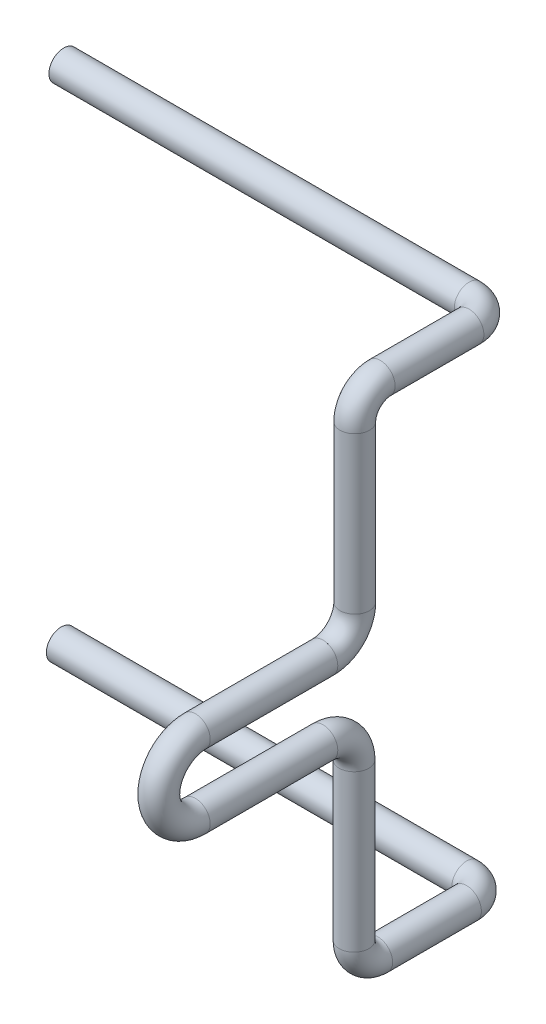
ISO-10303-21;
HEADER;
FILE_DESCRIPTION(('STEP AP214'),'2;1');
FILE_NAME('part.step','',(''),(''),'','','');
FILE_SCHEMA(('AUTOMOTIVE_DESIGN { 1 0 10303 214 1 1 1 1 }'));
ENDSEC;
DATA;
#1=APPLICATION_CONTEXT('core data for automotive mechanical design processes');
#2=APPLICATION_PROTOCOL_DEFINITION('international standard','automotive_design',2000,#1);
#3=PRODUCT_CONTEXT('',#1,'mechanical');
#4=PRODUCT('Part','Part','',(#3));
#5=PRODUCT_RELATED_PRODUCT_CATEGORY('part','',(#4));
#6=PRODUCT_DEFINITION_FORMATION('','',#4);
#7=PRODUCT_DEFINITION_CONTEXT('part definition',#1,'design');
#8=PRODUCT_DEFINITION('design','',#6,#7);
#9=PRODUCT_DEFINITION_SHAPE('','',#8);
#10=(LENGTH_UNIT() NAMED_UNIT(*) SI_UNIT(.MILLI.,.METRE.));
#11=(NAMED_UNIT(*) PLANE_ANGLE_UNIT() SI_UNIT($,.RADIAN.));
#12=(NAMED_UNIT(*) SI_UNIT($,.STERADIAN.) SOLID_ANGLE_UNIT());
#13=UNCERTAINTY_MEASURE_WITH_UNIT(LENGTH_MEASURE(1.E-05),#10,'distance_accuracy_value','');
#14=(GEOMETRIC_REPRESENTATION_CONTEXT(3) GLOBAL_UNCERTAINTY_ASSIGNED_CONTEXT((#13)) GLOBAL_UNIT_ASSIGNED_CONTEXT((#10,
#11,#12)) REPRESENTATION_CONTEXT('',''));
#15=CARTESIAN_POINT('',(0.,0.,0.));
#16=DIRECTION('',(0.,0.,1.));
#17=DIRECTION('',(1.,0.,0.));
#18=AXIS2_PLACEMENT_3D('',#15,#16,#17);
#19=CARTESIAN_POINT('',(0.,2.72788321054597,0.));
#20=DIRECTION('',(-1.,0.,0.));
#21=DIRECTION('',(0.,0.,1.));
#22=AXIS2_PLACEMENT_3D('',#19,#20,#21);
#23=TOROIDAL_SURFACE('',#22,2.72788321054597,1.27);
#24=CARTESIAN_POINT('',(0.,2.72788321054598,-2.72788321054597));
#25=DIRECTION('',(0.,1.,0.));
#26=DIRECTION('',(-1.,0.,0.));
#27=AXIS2_PLACEMENT_3D('',#24,#25,#26);
#28=CIRCLE('',#27,1.27);
#29=CARTESIAN_POINT('',(0.,2.72788321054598,-3.99788321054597));
#30=VERTEX_POINT('',#29);
#31=EDGE_CURVE('E13',#30,#30,#28,.T.);
#32=CARTESIAN_POINT('',(0.,0.,0.));
#33=DIRECTION('',(0.,0.,-1.));
#34=DIRECTION('',(-1.,0.,0.));
#35=AXIS2_PLACEMENT_3D('',#32,#33,#34);
#36=CIRCLE('',#35,1.27);
#37=CARTESIAN_POINT('',(0.,-1.27,0.));
#38=VERTEX_POINT('',#37);
#39=EDGE_CURVE('E58',#38,#38,#36,.T.);
#40=CARTESIAN_POINT('',(0.,2.72788321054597,0.));
#41=DIRECTION('',(-1.,0.,0.));
#42=DIRECTION('',(0.,0.,1.));
#43=AXIS2_PLACEMENT_3D('',#40,#41,#42);
#44=CIRCLE('',#43,3.99788321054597);
#45=EDGE_CURVE('',#30,#38,#44,.T.);
#46=ORIENTED_EDGE('',*,*,#31,.F.);
#47=ORIENTED_EDGE('',*,*,#39,.T.);
#48=ORIENTED_EDGE('',*,*,#45,.T.);
#49=ORIENTED_EDGE('',*,*,#45,.F.);
#50=EDGE_LOOP('',(#46,#48,#47,#49));
#51=FACE_BOUND('',#50,.T.);
#52=ADVANCED_FACE('F52',(#51),#23,.T.);
#53=CARTESIAN_POINT('',(0.,0.,0.));
#54=DIRECTION('',(0.,0.,-1.));
#55=DIRECTION('',(-1.,0.,0.));
#56=AXIS2_PLACEMENT_3D('',#53,#54,#55);
#57=PLANE('',#56);
#58=ORIENTED_EDGE('',*,*,#39,.F.);
#59=EDGE_LOOP('',(#58));
#60=FACE_BOUND('',#59,.T.);
#61=ADVANCED_FACE('F109',(#60),#57,.F.);
#62=CARTESIAN_POINT('',(0.,16.139083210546,-2.72788321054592));
#63=DIRECTION('',(0.,-1.,0.));
#64=DIRECTION('',(0.,0.,-1.));
#65=AXIS2_PLACEMENT_3D('',#62,#63,#64);
#66=CYLINDRICAL_SURFACE('',#65,1.27);
#67=CARTESIAN_POINT('',(0.,16.139083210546,-2.72788321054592));
#68=DIRECTION('',(0.,1.,0.));
#69=DIRECTION('',(0.,0.,1.));
#70=AXIS2_PLACEMENT_3D('',#67,#68,#69);
#71=CIRCLE('',#70,1.27);
#72=CARTESIAN_POINT('',(0.,16.139083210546,-1.45788321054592));
#73=VERTEX_POINT('',#72);
#74=EDGE_CURVE('E62',#73,#73,#71,.T.);
#75=ORIENTED_EDGE('',*,*,#74,.F.);
#76=EDGE_LOOP('',(#75));
#77=FACE_BOUND('',#76,.T.);
#78=ORIENTED_EDGE('',*,*,#31,.T.);
#79=EDGE_LOOP('',(#78));
#80=FACE_BOUND('',#79,.T.);
#81=ADVANCED_FACE('F104',(#77,#80),#66,.T.);
#82=CARTESIAN_POINT('',(0.,16.139083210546,-4.92086350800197));
#83=DIRECTION('',(1.,0.,0.));
#84=DIRECTION('',(0.,0.,-1.));
#85=AXIS2_PLACEMENT_3D('',#82,#83,#84);
#86=TOROIDAL_SURFACE('',#85,2.19298029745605,1.27);
#87=CARTESIAN_POINT('',(0.,18.332063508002,-4.92086350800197));
#88=DIRECTION('',(0.,0.,-1.));
#89=DIRECTION('',(0.,1.,0.));
#90=AXIS2_PLACEMENT_3D('',#87,#88,#89);
#91=CIRCLE('',#90,1.27);
#92=CARTESIAN_POINT('',(0.,19.602063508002,-4.92086350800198));
#93=VERTEX_POINT('',#92);
#94=EDGE_CURVE('E66',#93,#93,#91,.T.);
#95=CARTESIAN_POINT('',(0.,16.139083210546,-4.92086350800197));
#96=DIRECTION('',(1.,0.,0.));
#97=DIRECTION('',(0.,0.,-1.));
#98=AXIS2_PLACEMENT_3D('',#95,#96,#97);
#99=CIRCLE('',#98,3.46298029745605);
#100=EDGE_CURVE('',#93,#73,#99,.T.);
#101=ORIENTED_EDGE('',*,*,#94,.F.);
#102=ORIENTED_EDGE('',*,*,#74,.T.);
#103=ORIENTED_EDGE('',*,*,#100,.T.);
#104=ORIENTED_EDGE('',*,*,#100,.F.);
#105=EDGE_LOOP('',(#101,#103,#102,#104));
#106=FACE_BOUND('',#105,.T.);
#107=ADVANCED_FACE('F98',(#106),#86,.T.);
#108=CARTESIAN_POINT('',(0.,18.332063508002,-12.540863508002));
#109=DIRECTION('',(0.,0.,1.));
#110=DIRECTION('',(1.,0.,0.));
#111=AXIS2_PLACEMENT_3D('',#108,#109,#110);
#112=CYLINDRICAL_SURFACE('',#111,1.27);
#113=CARTESIAN_POINT('',(0.,18.332063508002,-12.540863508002));
#114=DIRECTION('',(0.,0.,-1.));
#115=DIRECTION('',(-1.,0.,0.));
#116=AXIS2_PLACEMENT_3D('',#113,#114,#115);
#117=CIRCLE('',#116,1.27);
#118=CARTESIAN_POINT('',(1.27,18.332063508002,-12.540863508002));
#119=VERTEX_POINT('',#118);
#120=EDGE_CURVE('E71',#119,#119,#117,.T.);
#121=ORIENTED_EDGE('',*,*,#120,.F.);
#122=EDGE_LOOP('',(#121));
#123=FACE_BOUND('',#122,.T.);
#124=ORIENTED_EDGE('',*,*,#94,.T.);
#125=EDGE_LOOP('',(#124));
#126=FACE_BOUND('',#125,.T.);
#127=ADVANCED_FACE('F92',(#123,#126),#112,.T.);
#128=CARTESIAN_POINT('',(-2.00782898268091,18.332063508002,-12.540863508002));
#129=DIRECTION('',(0.,-1.,0.));
#130=DIRECTION('',(0.,0.,-1.));
#131=AXIS2_PLACEMENT_3D('',#128,#129,#130);
#132=TOROIDAL_SURFACE('',#131,2.00782898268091,1.27);
#133=CARTESIAN_POINT('',(-2.00782898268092,18.332063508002,-14.5486924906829));
#134=DIRECTION('',(-1.,0.,0.));
#135=DIRECTION('',(0.,0.,1.));
#136=AXIS2_PLACEMENT_3D('',#133,#134,#135);
#137=CIRCLE('',#136,1.27);
#138=CARTESIAN_POINT('',(-2.00782898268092,18.332063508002,-15.8186924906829));
#139=VERTEX_POINT('',#138);
#140=EDGE_CURVE('E74',#139,#139,#137,.T.);
#141=CARTESIAN_POINT('',(-2.00782898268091,18.332063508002,-12.540863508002));
#142=DIRECTION('',(0.,-1.,0.));
#143=DIRECTION('',(0.,0.,-1.));
#144=AXIS2_PLACEMENT_3D('',#141,#142,#143);
#145=CIRCLE('',#144,3.27782898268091);
#146=EDGE_CURVE('',#139,#119,#145,.T.);
#147=ORIENTED_EDGE('',*,*,#140,.F.);
#148=ORIENTED_EDGE('',*,*,#120,.T.);
#149=ORIENTED_EDGE('',*,*,#146,.T.);
#150=ORIENTED_EDGE('',*,*,#146,.F.);
#151=EDGE_LOOP('',(#147,#149,#148,#150));
#152=FACE_BOUND('',#151,.T.);
#153=ADVANCED_FACE('F86',(#152),#132,.T.);
#154=CARTESIAN_POINT('',(-36.8058289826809,18.332063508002,-14.5486924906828));
#155=DIRECTION('',(1.,0.,0.));
#156=DIRECTION('',(0.,0.,-1.));
#157=AXIS2_PLACEMENT_3D('',#154,#155,#156);
#158=CYLINDRICAL_SURFACE('',#157,1.27);
#159=CARTESIAN_POINT('',(-36.8058289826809,18.332063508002,-14.5486924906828));
#160=DIRECTION('',(-1.,0.,0.));
#161=DIRECTION('',(0.,0.,1.));
#162=AXIS2_PLACEMENT_3D('',#159,#160,#161);
#163=CIRCLE('',#162,1.27);
#164=CARTESIAN_POINT('',(-36.8058289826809,18.332063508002,-13.2786924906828));
#165=VERTEX_POINT('',#164);
#166=EDGE_CURVE('E77',#165,#165,#163,.T.);
#167=ORIENTED_EDGE('',*,*,#166,.F.);
#168=EDGE_LOOP('',(#167));
#169=FACE_BOUND('',#168,.T.);
#170=ORIENTED_EDGE('',*,*,#140,.T.);
#171=EDGE_LOOP('',(#170));
#172=FACE_BOUND('',#171,.T.);
#173=ADVANCED_FACE('F83',(#169,#172),#158,.T.);
#174=CARTESIAN_POINT('',(-36.8058289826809,18.332063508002,-14.5486924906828));
#175=DIRECTION('',(-1.,0.,0.));
#176=DIRECTION('',(0.,0.,1.));
#177=AXIS2_PLACEMENT_3D('',#174,#175,#176);
#178=PLANE('',#177);
#179=ORIENTED_EDGE('',*,*,#166,.T.);
#180=EDGE_LOOP('',(#179));
#181=FACE_BOUND('',#180,.T.);
#182=ADVANCED_FACE('F81',(#181),#178,.T.);
#183=CLOSED_SHELL('',(#52,#61,#81,#107,#127,#153,#173,#182));
#184=MANIFOLD_SOLID_BREP('B2',#183);
#185=CARTESIAN_POINT('',(0.,0.,10.9474));
#186=DIRECTION('',(0.,0.,-1.));
#187=DIRECTION('',(-1.,0.,0.));
#188=AXIS2_PLACEMENT_3D('',#185,#186,#187);
#189=CYLINDRICAL_SURFACE('',#188,1.27);
#190=CARTESIAN_POINT('',(0.,0.,10.9474));
#191=DIRECTION('',(0.,0.,1.));
#192=DIRECTION('',(1.,0.,0.));
#193=AXIS2_PLACEMENT_3D('',#190,#191,#192);
#194=CIRCLE('',#193,1.27);
#195=CARTESIAN_POINT('',(0.,1.27,10.9474));
#196=VERTEX_POINT('',#195);
#197=EDGE_CURVE('E51',#196,#196,#194,.T.);
#198=ORIENTED_EDGE('',*,*,#197,.F.);
#199=EDGE_LOOP('',(#198));
#200=FACE_BOUND('',#199,.T.);
#201=CARTESIAN_POINT('',(0.,0.,0.));
#202=DIRECTION('',(0.,0.,1.));
#203=DIRECTION('',(1.,0.,0.));
#204=AXIS2_PLACEMENT_3D('',#201,#202,#203);
#205=CIRCLE('',#204,1.27);
#206=CARTESIAN_POINT('',(1.27,0.,0.));
#207=VERTEX_POINT('',#206);
#208=EDGE_CURVE('E176',#207,#207,#205,.T.);
#209=ORIENTED_EDGE('',*,*,#208,.T.);
#210=EDGE_LOOP('',(#209));
#211=FACE_BOUND('',#210,.T.);
#212=ADVANCED_FACE('F173',(#200,#211),#189,.T.);
#213=CARTESIAN_POINT('',(0.,0.,0.));
#214=DIRECTION('',(0.,0.,1.));
#215=DIRECTION('',(1.,0.,0.));
#216=AXIS2_PLACEMENT_3D('',#213,#214,#215);
#217=PLANE('',#216);
#218=ORIENTED_EDGE('',*,*,#208,.F.);
#219=EDGE_LOOP('',(#218));
#220=FACE_BOUND('',#219,.T.);
#221=ADVANCED_FACE('F255',(#220),#217,.F.);
#222=CARTESIAN_POINT('',(0.,-3.14575099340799,10.9474));
#223=DIRECTION('',(-1.,0.,0.));
#224=DIRECTION('',(0.,0.,1.));
#225=AXIS2_PLACEMENT_3D('',#222,#223,#224);
#226=TOROIDAL_SURFACE('',#225,3.14575099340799,1.27);
#227=CARTESIAN_POINT('',(0.,-6.29150198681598,10.9474));
#228=DIRECTION('',(0.,0.,-1.));
#229=DIRECTION('',(1.,0.,0.));
#230=AXIS2_PLACEMENT_3D('',#227,#228,#229);
#231=CIRCLE('',#230,1.27);
#232=CARTESIAN_POINT('',(0.,-7.56150198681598,10.9474));
#233=VERTEX_POINT('',#232);
#234=EDGE_CURVE('E183',#233,#233,#231,.T.);
#235=CARTESIAN_POINT('',(0.,-3.14575099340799,10.9474));
#236=DIRECTION('',(-1.,0.,0.));
#237=DIRECTION('',(0.,0.,1.));
#238=AXIS2_PLACEMENT_3D('',#235,#236,#237);
#239=CIRCLE('',#238,4.41575099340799);
#240=EDGE_CURVE('',#233,#196,#239,.T.);
#241=ORIENTED_EDGE('',*,*,#234,.F.);
#242=ORIENTED_EDGE('',*,*,#197,.T.);
#243=ORIENTED_EDGE('',*,*,#240,.T.);
#244=ORIENTED_EDGE('',*,*,#240,.F.);
#245=EDGE_LOOP('',(#241,#243,#242,#244));
#246=FACE_BOUND('',#245,.T.);
#247=ADVANCED_FACE('F250',(#246),#226,.T.);
#248=CARTESIAN_POINT('',(0.,-6.29150198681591,0.));
#249=DIRECTION('',(0.,0.,1.));
#250=DIRECTION('',(0.,-1.,0.));
#251=AXIS2_PLACEMENT_3D('',#248,#249,#250);
#252=CYLINDRICAL_SURFACE('',#251,1.26999999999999);
#253=CARTESIAN_POINT('',(0.,-6.29150198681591,0.));
#254=DIRECTION('',(0.,0.,-1.));
#255=DIRECTION('',(0.,1.,0.));
#256=AXIS2_PLACEMENT_3D('',#253,#254,#255);
#257=CIRCLE('',#256,1.26999999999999);
#258=CARTESIAN_POINT('',(0.,-5.02150198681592,0.));
#259=VERTEX_POINT('',#258);
#260=EDGE_CURVE('E187',#259,#259,#257,.T.);
#261=ORIENTED_EDGE('',*,*,#260,.F.);
#262=EDGE_LOOP('',(#261));
#263=FACE_BOUND('',#262,.T.);
#264=ORIENTED_EDGE('',*,*,#234,.T.);
#265=EDGE_LOOP('',(#264));
#266=FACE_BOUND('',#265,.T.);
#267=ADVANCED_FACE('F244',(#263,#266),#252,.T.);
#268=CARTESIAN_POINT('',(0.,-8.9569716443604,0.));
#269=DIRECTION('',(1.,0.,0.));
#270=DIRECTION('',(0.,0.,-1.));
#271=AXIS2_PLACEMENT_3D('',#268,#269,#270);
#272=TOROIDAL_SURFACE('',#271,2.66546965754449,1.26999999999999);
#273=CARTESIAN_POINT('',(0.,-8.95697164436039,-2.66546965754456));
#274=DIRECTION('',(0.,-1.,0.));
#275=DIRECTION('',(0.,0.,-1.));
#276=AXIS2_PLACEMENT_3D('',#273,#274,#275);
#277=CIRCLE('',#276,1.26999999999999);
#278=CARTESIAN_POINT('',(0.,-8.95697164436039,-3.93546965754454));
#279=VERTEX_POINT('',#278);
#280=EDGE_CURVE('E190',#279,#279,#277,.T.);
#281=CARTESIAN_POINT('',(0.,-8.9569716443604,0.));
#282=DIRECTION('',(1.,0.,0.));
#283=DIRECTION('',(0.,0.,-1.));
#284=AXIS2_PLACEMENT_3D('',#281,#282,#283);
#285=CIRCLE('',#284,3.93546965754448);
#286=EDGE_CURVE('',#279,#259,#285,.T.);
#287=ORIENTED_EDGE('',*,*,#280,.F.);
#288=ORIENTED_EDGE('',*,*,#260,.T.);
#289=ORIENTED_EDGE('',*,*,#286,.T.);
#290=ORIENTED_EDGE('',*,*,#286,.F.);
#291=EDGE_LOOP('',(#287,#289,#288,#290));
#292=FACE_BOUND('',#291,.T.);
#293=ADVANCED_FACE('F238',(#292),#272,.T.);
#294=CARTESIAN_POINT('',(0.,-22.3681716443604,-2.6654696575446));
#295=DIRECTION('',(0.,1.,0.));
#296=DIRECTION('',(0.,0.,1.));
#297=AXIS2_PLACEMENT_3D('',#294,#295,#296);
#298=CYLINDRICAL_SURFACE('',#297,1.26999999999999);
#299=CARTESIAN_POINT('',(0.,-22.3681716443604,-2.6654696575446));
#300=DIRECTION('',(0.,-1.,0.));
#301=DIRECTION('',(0.,0.,-1.));
#302=AXIS2_PLACEMENT_3D('',#299,#300,#301);
#303=CIRCLE('',#302,1.26999999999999);
#304=CARTESIAN_POINT('',(0.,-22.3681716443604,-1.39546965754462));
#305=VERTEX_POINT('',#304);
#306=EDGE_CURVE('E193',#305,#305,#303,.T.);
#307=ORIENTED_EDGE('',*,*,#306,.F.);
#308=EDGE_LOOP('',(#307));
#309=FACE_BOUND('',#308,.T.);
#310=ORIENTED_EDGE('',*,*,#280,.T.);
#311=EDGE_LOOP('',(#310));
#312=FACE_BOUND('',#311,.T.);
#313=ADVANCED_FACE('F232',(#309,#312),#298,.T.);
#314=CARTESIAN_POINT('',(0.,-22.3681716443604,-4.70613397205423));
#315=DIRECTION('',(-1.,0.,0.));
#316=DIRECTION('',(0.,0.,1.));
#317=AXIS2_PLACEMENT_3D('',#314,#315,#316);
#318=TOROIDAL_SURFACE('',#317,2.04066431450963,1.26999999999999);
#319=CARTESIAN_POINT('',(0.,-24.40883595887,-4.70613397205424));
#320=DIRECTION('',(0.,0.,-1.));
#321=DIRECTION('',(0.,1.,0.));
#322=AXIS2_PLACEMENT_3D('',#319,#320,#321);
#323=CIRCLE('',#322,1.26999999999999);
#324=CARTESIAN_POINT('',(0.,-25.67883595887,-4.70613397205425));
#325=VERTEX_POINT('',#324);
#326=EDGE_CURVE('E196',#325,#325,#323,.T.);
#327=CARTESIAN_POINT('',(0.,-22.3681716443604,-4.70613397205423));
#328=DIRECTION('',(-1.,0.,0.));
#329=DIRECTION('',(0.,0.,1.));
#330=AXIS2_PLACEMENT_3D('',#327,#328,#329);
#331=CIRCLE('',#330,3.31066431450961);
#332=EDGE_CURVE('',#325,#305,#331,.T.);
#333=ORIENTED_EDGE('',*,*,#326,.F.);
#334=ORIENTED_EDGE('',*,*,#306,.T.);
#335=ORIENTED_EDGE('',*,*,#332,.T.);
#336=ORIENTED_EDGE('',*,*,#332,.F.);
#337=EDGE_LOOP('',(#333,#335,#334,#336));
#338=FACE_BOUND('',#337,.T.);
#339=ADVANCED_FACE('F226',(#338),#318,.T.);
#340=CARTESIAN_POINT('',(0.,-24.40883595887,-12.3261339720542));
#341=DIRECTION('',(0.,0.,1.));
#342=DIRECTION('',(0.,-1.,0.));
#343=AXIS2_PLACEMENT_3D('',#340,#341,#342);
#344=CYLINDRICAL_SURFACE('',#343,1.26999999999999);
#345=CARTESIAN_POINT('',(0.,-24.40883595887,-12.3261339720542));
#346=DIRECTION('',(0.,0.,-1.));
#347=DIRECTION('',(0.,1.,0.));
#348=AXIS2_PLACEMENT_3D('',#345,#346,#347);
#349=CIRCLE('',#348,1.26999999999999);
#350=CARTESIAN_POINT('',(1.26999999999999,-24.40883595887,-12.3261339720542));
#351=VERTEX_POINT('',#350);
#352=EDGE_CURVE('E199',#351,#351,#349,.T.);
#353=ORIENTED_EDGE('',*,*,#352,.F.);
#354=EDGE_LOOP('',(#353));
#355=FACE_BOUND('',#354,.T.);
#356=ORIENTED_EDGE('',*,*,#326,.T.);
#357=EDGE_LOOP('',(#356));
#358=FACE_BOUND('',#357,.T.);
#359=ADVANCED_FACE('F220',(#355,#358),#344,.T.);
#360=CARTESIAN_POINT('',(-1.82175724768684,-24.40883595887,-12.3261339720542));
#361=DIRECTION('',(0.,-1.,0.));
#362=DIRECTION('',(0.,0.,-1.));
#363=AXIS2_PLACEMENT_3D('',#360,#361,#362);
#364=TOROIDAL_SURFACE('',#363,1.82175724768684,1.26999999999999);
#365=CARTESIAN_POINT('',(-1.82175724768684,-24.4088359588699,-14.1478912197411));
#366=DIRECTION('',(-1.,0.,0.));
#367=DIRECTION('',(0.,1.,0.));
#368=AXIS2_PLACEMENT_3D('',#365,#366,#367);
#369=CIRCLE('',#368,1.26999999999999);
#370=CARTESIAN_POINT('',(-1.82175724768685,-24.4088359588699,-15.4178912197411));
#371=VERTEX_POINT('',#370);
#372=EDGE_CURVE('E202',#371,#371,#369,.T.);
#373=CARTESIAN_POINT('',(-1.82175724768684,-24.40883595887,-12.3261339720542));
#374=DIRECTION('',(0.,-1.,0.));
#375=DIRECTION('',(0.,0.,-1.));
#376=AXIS2_PLACEMENT_3D('',#373,#374,#375);
#377=CIRCLE('',#376,3.09175724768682);
#378=EDGE_CURVE('',#371,#351,#377,.T.);
#379=ORIENTED_EDGE('',*,*,#372,.F.);
#380=ORIENTED_EDGE('',*,*,#352,.T.);
#381=ORIENTED_EDGE('',*,*,#378,.T.);
#382=ORIENTED_EDGE('',*,*,#378,.F.);
#383=EDGE_LOOP('',(#379,#381,#380,#382));
#384=FACE_BOUND('',#383,.T.);
#385=ADVANCED_FACE('F214',(#384),#364,.T.);
#386=CARTESIAN_POINT('',(-36.6197572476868,-24.40883595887,-14.147891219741));
#387=DIRECTION('',(1.,0.,0.));
#388=DIRECTION('',(0.,0.,-1.));
#389=AXIS2_PLACEMENT_3D('',#386,#387,#388);
#390=CYLINDRICAL_SURFACE('',#389,1.26999999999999);
#391=CARTESIAN_POINT('',(-36.6197572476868,-24.40883595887,-14.147891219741));
#392=DIRECTION('',(-1.,0.,0.));
#393=DIRECTION('',(0.,0.,1.));
#394=AXIS2_PLACEMENT_3D('',#391,#392,#393);
#395=CIRCLE('',#394,1.26999999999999);
#396=CARTESIAN_POINT('',(-36.6197572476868,-24.40883595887,-12.877891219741));
#397=VERTEX_POINT('',#396);
#398=EDGE_CURVE('E205',#397,#397,#395,.T.);
#399=ORIENTED_EDGE('',*,*,#398,.F.);
#400=EDGE_LOOP('',(#399));
#401=FACE_BOUND('',#400,.T.);
#402=ORIENTED_EDGE('',*,*,#372,.T.);
#403=EDGE_LOOP('',(#402));
#404=FACE_BOUND('',#403,.T.);
#405=ADVANCED_FACE('F211',(#401,#404),#390,.T.);
#406=CARTESIAN_POINT('',(-36.6197572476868,-24.40883595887,-14.147891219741));
#407=DIRECTION('',(-1.,0.,0.));
#408=DIRECTION('',(0.,0.,1.));
#409=AXIS2_PLACEMENT_3D('',#406,#407,#408);
#410=PLANE('',#409);
#411=ORIENTED_EDGE('',*,*,#398,.T.);
#412=EDGE_LOOP('',(#411));
#413=FACE_BOUND('',#412,.T.);
#414=ADVANCED_FACE('F209',(#413),#410,.T.);
#415=CLOSED_SHELL('',(#212,#221,#247,#267,#293,#313,#339,#359,#385,#405,#414));
#416=MANIFOLD_SOLID_BREP('B8',#415);
#417=ADVANCED_BREP_SHAPE_REPRESENTATION('',(#18,#184,#416),#14);
#418=SHAPE_DEFINITION_REPRESENTATION(#9,#417);
ENDSEC;
END-ISO-10303-21;
